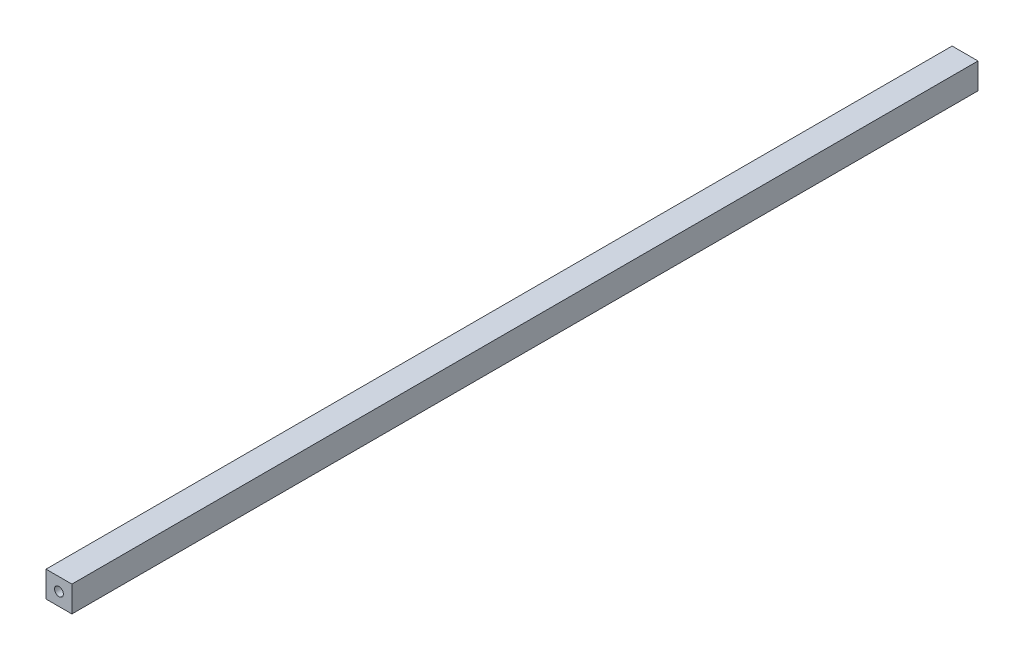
ISO-10303-21;
HEADER;
FILE_DESCRIPTION(('STEP AP214'),'2;1');
FILE_NAME('part.step','',(''),(''),'','','');
FILE_SCHEMA(('AUTOMOTIVE_DESIGN { 1 0 10303 214 1 1 1 1 }'));
ENDSEC;
DATA;
#1=APPLICATION_CONTEXT('core data for automotive mechanical design processes');
#2=APPLICATION_PROTOCOL_DEFINITION('international standard','automotive_design',2000,#1);
#3=PRODUCT_CONTEXT('',#1,'mechanical');
#4=PRODUCT('Part','Part','',(#3));
#5=PRODUCT_RELATED_PRODUCT_CATEGORY('part','',(#4));
#6=PRODUCT_DEFINITION_FORMATION('','',#4);
#7=PRODUCT_DEFINITION_CONTEXT('part definition',#1,'design');
#8=PRODUCT_DEFINITION('design','',#6,#7);
#9=PRODUCT_DEFINITION_SHAPE('','',#8);
#10=(LENGTH_UNIT() NAMED_UNIT(*) SI_UNIT(.MILLI.,.METRE.));
#11=(NAMED_UNIT(*) PLANE_ANGLE_UNIT() SI_UNIT($,.RADIAN.));
#12=(NAMED_UNIT(*) SI_UNIT($,.STERADIAN.) SOLID_ANGLE_UNIT());
#13=UNCERTAINTY_MEASURE_WITH_UNIT(LENGTH_MEASURE(1.E-05),#10,'distance_accuracy_value','');
#14=(GEOMETRIC_REPRESENTATION_CONTEXT(3) GLOBAL_UNCERTAINTY_ASSIGNED_CONTEXT((#13)) GLOBAL_UNIT_ASSIGNED_CONTEXT((#10,
#11,#12)) REPRESENTATION_CONTEXT('',''));
#15=CARTESIAN_POINT('',(0.,0.,0.));
#16=DIRECTION('',(0.,0.,1.));
#17=DIRECTION('',(1.,0.,0.));
#18=AXIS2_PLACEMENT_3D('',#15,#16,#17);
#19=CARTESIAN_POINT('',(-10.,-9.9999999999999,350.));
#20=DIRECTION('',(1.,0.,0.));
#21=DIRECTION('',(0.,0.,-1.));
#22=AXIS2_PLACEMENT_3D('',#19,#20,#21);
#23=PLANE('',#22);
#24=DIRECTION('',(0.,-1.,0.));
#25=VECTOR('',#24,1.);
#26=CARTESIAN_POINT('',(-10.,-9.99999999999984,-350.));
#27=LINE('',#26,#25);
#28=CARTESIAN_POINT('',(-10.,9.99999999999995,-350.));
#29=VERTEX_POINT('',#28);
#30=CARTESIAN_POINT('',(-10.,-9.99999999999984,-350.));
#31=VERTEX_POINT('',#30);
#32=EDGE_CURVE('E108',#29,#31,#27,.T.);
#33=ORIENTED_EDGE('',*,*,#32,.T.);
#34=DIRECTION('',(0.,0.,-1.));
#35=VECTOR('',#34,1.);
#36=CARTESIAN_POINT('',(-10.,-9.9999999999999,350.));
#37=LINE('',#36,#35);
#38=CARTESIAN_POINT('',(-10.,-9.9999999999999,350.));
#39=VERTEX_POINT('',#38);
#40=EDGE_CURVE('E11',#39,#31,#37,.T.);
#41=ORIENTED_EDGE('',*,*,#40,.F.);
#42=DIRECTION('',(0.,-1.,0.));
#43=VECTOR('',#42,1.);
#44=CARTESIAN_POINT('',(-10.,-9.9999999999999,350.));
#45=LINE('',#44,#43);
#46=CARTESIAN_POINT('',(-10.,9.99999999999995,350.));
#47=VERTEX_POINT('',#46);
#48=EDGE_CURVE('E121',#47,#39,#45,.T.);
#49=ORIENTED_EDGE('',*,*,#48,.F.);
#50=DIRECTION('',(0.,0.,-1.));
#51=VECTOR('',#50,1.);
#52=CARTESIAN_POINT('',(-10.,9.99999999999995,350.));
#53=LINE('',#52,#51);
#54=EDGE_CURVE('E131',#47,#29,#53,.T.);
#55=ORIENTED_EDGE('',*,*,#54,.T.);
#56=EDGE_LOOP('',(#33,#41,#49,#55));
#57=FACE_BOUND('',#56,.T.);
#58=ADVANCED_FACE('F38',(#57),#23,.F.);
#59=CARTESIAN_POINT('',(-10.,-9.9999999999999,350.));
#60=DIRECTION('',(0.,1.,0.));
#61=DIRECTION('',(0.,0.,1.));
#62=AXIS2_PLACEMENT_3D('',#59,#60,#61);
#63=PLANE('',#62);
#64=DIRECTION('',(1.,0.,0.));
#65=VECTOR('',#64,1.);
#66=CARTESIAN_POINT('',(-10.,-9.99999999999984,-350.));
#67=LINE('',#66,#65);
#68=CARTESIAN_POINT('',(10.,-9.99999999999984,-350.));
#69=VERTEX_POINT('',#68);
#70=EDGE_CURVE('E112',#31,#69,#67,.T.);
#71=ORIENTED_EDGE('',*,*,#70,.T.);
#72=DIRECTION('',(0.,0.,-1.));
#73=VECTOR('',#72,1.);
#74=CARTESIAN_POINT('',(10.,-10.0000000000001,350.));
#75=LINE('',#74,#73);
#76=CARTESIAN_POINT('',(10.,-10.0000000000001,350.));
#77=VERTEX_POINT('',#76);
#78=EDGE_CURVE('E46',#77,#69,#75,.T.);
#79=ORIENTED_EDGE('',*,*,#78,.F.);
#80=DIRECTION('',(1.,0.,0.));
#81=VECTOR('',#80,1.);
#82=CARTESIAN_POINT('',(-10.,-9.9999999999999,350.));
#83=LINE('',#82,#81);
#84=EDGE_CURVE('E124',#39,#77,#83,.T.);
#85=ORIENTED_EDGE('',*,*,#84,.F.);
#86=ORIENTED_EDGE('',*,*,#40,.T.);
#87=EDGE_LOOP('',(#71,#79,#85,#86));
#88=FACE_BOUND('',#87,.T.);
#89=ADVANCED_FACE('F154',(#88),#63,.F.);
#90=CARTESIAN_POINT('',(10.,-10.0000000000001,350.));
#91=DIRECTION('',(-1.,0.,0.));
#92=DIRECTION('',(0.,0.,1.));
#93=AXIS2_PLACEMENT_3D('',#90,#91,#92);
#94=PLANE('',#93);
#95=DIRECTION('',(0.,1.,0.));
#96=VECTOR('',#95,1.);
#97=CARTESIAN_POINT('',(10.,-9.99999999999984,-350.));
#98=LINE('',#97,#96);
#99=CARTESIAN_POINT('',(10.,9.99999999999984,-350.));
#100=VERTEX_POINT('',#99);
#101=EDGE_CURVE('E115',#69,#100,#98,.T.);
#102=ORIENTED_EDGE('',*,*,#101,.T.);
#103=DIRECTION('',(0.,0.,-1.));
#104=VECTOR('',#103,1.);
#105=CARTESIAN_POINT('',(10.,10.0000000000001,350.));
#106=LINE('',#105,#104);
#107=CARTESIAN_POINT('',(10.,10.0000000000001,350.));
#108=VERTEX_POINT('',#107);
#109=EDGE_CURVE('E135',#108,#100,#106,.T.);
#110=ORIENTED_EDGE('',*,*,#109,.F.);
#111=DIRECTION('',(0.,1.,0.));
#112=VECTOR('',#111,1.);
#113=CARTESIAN_POINT('',(10.,-10.0000000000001,350.));
#114=LINE('',#113,#112);
#115=EDGE_CURVE('E58',#77,#108,#114,.T.);
#116=ORIENTED_EDGE('',*,*,#115,.F.);
#117=ORIENTED_EDGE('',*,*,#78,.T.);
#118=EDGE_LOOP('',(#102,#110,#116,#117));
#119=FACE_BOUND('',#118,.T.);
#120=ADVANCED_FACE('F142',(#119),#94,.F.);
#121=CARTESIAN_POINT('',(-10.,9.99999999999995,350.));
#122=DIRECTION('',(0.,-1.,0.));
#123=DIRECTION('',(0.,0.,-1.));
#124=AXIS2_PLACEMENT_3D('',#121,#122,#123);
#125=PLANE('',#124);
#126=DIRECTION('',(-1.,0.,0.));
#127=VECTOR('',#126,1.);
#128=CARTESIAN_POINT('',(-10.,9.99999999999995,-350.));
#129=LINE('',#128,#127);
#130=EDGE_CURVE('E118',#100,#29,#129,.T.);
#131=ORIENTED_EDGE('',*,*,#130,.T.);
#132=ORIENTED_EDGE('',*,*,#54,.F.);
#133=DIRECTION('',(-1.,0.,0.));
#134=VECTOR('',#133,1.);
#135=CARTESIAN_POINT('',(-10.,9.99999999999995,350.));
#136=LINE('',#135,#134);
#137=EDGE_CURVE('E53',#108,#47,#136,.T.);
#138=ORIENTED_EDGE('',*,*,#137,.F.);
#139=ORIENTED_EDGE('',*,*,#109,.T.);
#140=EDGE_LOOP('',(#131,#132,#138,#139));
#141=FACE_BOUND('',#140,.T.);
#142=ADVANCED_FACE('F149',(#141),#125,.F.);
#143=CARTESIAN_POINT('',(-10.,9.99999999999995,350.));
#144=DIRECTION('',(0.,0.,-1.));
#145=DIRECTION('',(-1.,0.,0.));
#146=AXIS2_PLACEMENT_3D('',#143,#144,#145);
#147=PLANE('',#146);
#148=CARTESIAN_POINT('',(0.,1.11022302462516E-13,350.));
#149=DIRECTION('',(0.,0.,1.));
#150=DIRECTION('',(1.,0.,0.));
#151=AXIS2_PLACEMENT_3D('',#148,#149,#150);
#152=CIRCLE('',#151,3.39999999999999);
#153=CARTESIAN_POINT('',(3.39999999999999,1.10078612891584E-13,350.));
#154=VERTEX_POINT('',#153);
#155=EDGE_CURVE('E105',#154,#154,#152,.T.);
#156=ORIENTED_EDGE('',*,*,#155,.F.);
#157=EDGE_LOOP('',(#156));
#158=FACE_BOUND('',#157,.T.);
#159=ORIENTED_EDGE('',*,*,#48,.T.);
#160=ORIENTED_EDGE('',*,*,#84,.T.);
#161=ORIENTED_EDGE('',*,*,#115,.T.);
#162=ORIENTED_EDGE('',*,*,#137,.T.);
#163=EDGE_LOOP('',(#159,#160,#161,#162));
#164=FACE_BOUND('',#163,.T.);
#165=ADVANCED_FACE('F153',(#158,#164),#147,.F.);
#166=CARTESIAN_POINT('',(-10.,9.99999999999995,-350.));
#167=DIRECTION('',(0.,0.,-1.));
#168=DIRECTION('',(-1.,0.,0.));
#169=AXIS2_PLACEMENT_3D('',#166,#167,#168);
#170=PLANE('',#169);
#171=CARTESIAN_POINT('',(2.22044604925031E-13,-1.66533453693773E-13,-350.));
#172=DIRECTION('',(0.,0.,-1.));
#173=DIRECTION('',(-1.,0.,0.));
#174=AXIS2_PLACEMENT_3D('',#171,#172,#173);
#175=CIRCLE('',#174,3.39999999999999);
#176=CARTESIAN_POINT('',(-3.39999999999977,-1.65589764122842E-13,-350.));
#177=VERTEX_POINT('',#176);
#178=EDGE_CURVE('E93',#177,#177,#175,.T.);
#179=ORIENTED_EDGE('',*,*,#178,.F.);
#180=EDGE_LOOP('',(#179));
#181=FACE_BOUND('',#180,.T.);
#182=ORIENTED_EDGE('',*,*,#32,.F.);
#183=ORIENTED_EDGE('',*,*,#130,.F.);
#184=ORIENTED_EDGE('',*,*,#101,.F.);
#185=ORIENTED_EDGE('',*,*,#70,.F.);
#186=EDGE_LOOP('',(#182,#183,#184,#185));
#187=FACE_BOUND('',#186,.T.);
#188=ADVANCED_FACE('F147',(#181,#187),#170,.T.);
#189=CARTESIAN_POINT('',(0.,1.11022302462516E-13,350.));
#190=DIRECTION('',(0.,0.,1.));
#191=DIRECTION('',(1.,0.,0.));
#192=AXIS2_PLACEMENT_3D('',#189,#190,#191);
#193=CYLINDRICAL_SURFACE('',#192,3.39999999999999);
#194=CARTESIAN_POINT('',(0.,0.,330.));
#195=DIRECTION('',(0.,0.,1.));
#196=DIRECTION('',(1.,0.,0.));
#197=AXIS2_PLACEMENT_3D('',#194,#195,#196);
#198=CIRCLE('',#197,3.39999999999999);
#199=CARTESIAN_POINT('',(3.39999999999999,0.,330.));
#200=VERTEX_POINT('',#199);
#201=EDGE_CURVE('E99',#200,#200,#198,.T.);
#202=ORIENTED_EDGE('',*,*,#201,.F.);
#203=EDGE_LOOP('',(#202));
#204=FACE_BOUND('',#203,.T.);
#205=ORIENTED_EDGE('',*,*,#155,.T.);
#206=EDGE_LOOP('',(#205));
#207=FACE_BOUND('',#206,.T.);
#208=ADVANCED_FACE('F169',(#204,#207),#193,.F.);
#209=CARTESIAN_POINT('',(0.,0.,330.));
#210=DIRECTION('',(0.,0.,1.));
#211=DIRECTION('',(1.,0.,0.));
#212=AXIS2_PLACEMENT_3D('',#209,#210,#211);
#213=CONICAL_SURFACE('',#212,3.39999999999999,1.02974425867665);
#214=CARTESIAN_POINT('',(-2.22044604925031E-13,0.,327.957073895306));
#215=VERTEX_POINT('',#214);
#216=VERTEX_LOOP('',#215);
#217=FACE_BOUND('',#216,.T.);
#218=ORIENTED_EDGE('',*,*,#201,.T.);
#219=EDGE_LOOP('',(#218));
#220=FACE_BOUND('',#219,.T.);
#221=ADVANCED_FACE('F173',(#217,#220),#213,.F.);
#222=CARTESIAN_POINT('',(2.22044604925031E-13,-1.66533453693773E-13,-350.));
#223=DIRECTION('',(0.,0.,-1.));
#224=DIRECTION('',(-1.,0.,0.));
#225=AXIS2_PLACEMENT_3D('',#222,#223,#224);
#226=CYLINDRICAL_SURFACE('',#225,3.39999999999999);
#227=CARTESIAN_POINT('',(0.,0.,-330.));
#228=DIRECTION('',(0.,0.,-1.));
#229=DIRECTION('',(-1.,0.,0.));
#230=AXIS2_PLACEMENT_3D('',#227,#228,#229);
#231=CIRCLE('',#230,3.39999999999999);
#232=CARTESIAN_POINT('',(-3.39999999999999,0.,-330.));
#233=VERTEX_POINT('',#232);
#234=EDGE_CURVE('E90',#233,#233,#231,.T.);
#235=ORIENTED_EDGE('',*,*,#234,.F.);
#236=EDGE_LOOP('',(#235));
#237=FACE_BOUND('',#236,.T.);
#238=ORIENTED_EDGE('',*,*,#178,.T.);
#239=EDGE_LOOP('',(#238));
#240=FACE_BOUND('',#239,.T.);
#241=ADVANCED_FACE('F86',(#237,#240),#226,.F.);
#242=CARTESIAN_POINT('',(0.,0.,-330.));
#243=DIRECTION('',(0.,0.,-1.));
#244=DIRECTION('',(-1.,0.,0.));
#245=AXIS2_PLACEMENT_3D('',#242,#243,#244);
#246=CONICAL_SURFACE('',#245,3.39999999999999,1.02974425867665);
#247=CARTESIAN_POINT('',(0.,0.,-327.957073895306));
#248=VERTEX_POINT('',#247);
#249=VERTEX_LOOP('',#248);
#250=FACE_BOUND('',#249,.T.);
#251=ORIENTED_EDGE('',*,*,#234,.T.);
#252=EDGE_LOOP('',(#251));
#253=FACE_BOUND('',#252,.T.);
#254=ADVANCED_FACE('F83',(#250,#253),#246,.F.);
#255=CLOSED_SHELL('',(#58,#89,#120,#142,#165,#188,#208,#221,#241,#254));
#256=MANIFOLD_SOLID_BREP('B2',#255);
#257=ADVANCED_BREP_SHAPE_REPRESENTATION('',(#18,#256),#14);
#258=SHAPE_DEFINITION_REPRESENTATION(#9,#257);
ENDSEC;
END-ISO-10303-21;
